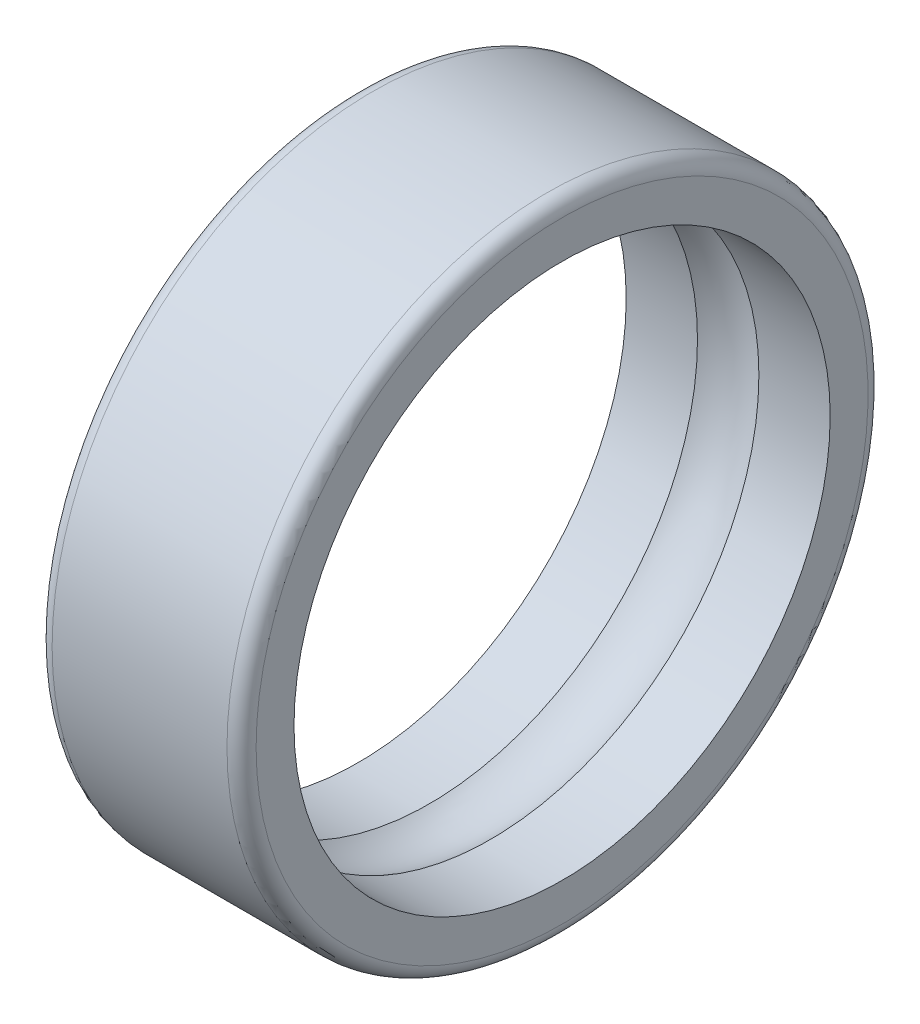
from build123d import *


with BuildPart() as part:
    # Esquisse1 → Base-R_volution (revolve)
    with BuildSketch(Plane.XY, mode=Mode.PRIVATE) as base_r_volution_sk:
        with BuildLine():
            Line((1.053565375, 9.2), (3.5, 9.2))
            Line((3.5, 9.2), (3.5, 10.5))
            ThreePointArc((3.5, 10.5), (3.353553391, 10.853553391), (3, 11))
            Line((3, 11), (-3, 11))
            ThreePointArc((-3, 11), (-3.353553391, 10.853553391), (-3.5, 10.5))
            Line((-3.5, 10.5), (-3.5, 9.2))
            Line((-3.5, 9.2), (-1.053565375, 9.2))
            ThreePointArc((-1.053565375, 9.2), (0, 9.5), (1.053565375, 9.2))
        make_face()
    revolve(base_r_volution_sk.sketch.rotate(Axis((-4.370908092, 0, 0), (1, 0, 0)), 90), axis=Axis((-4.370908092, 0, 0), (1, 0, 0)))


solid = part.part
